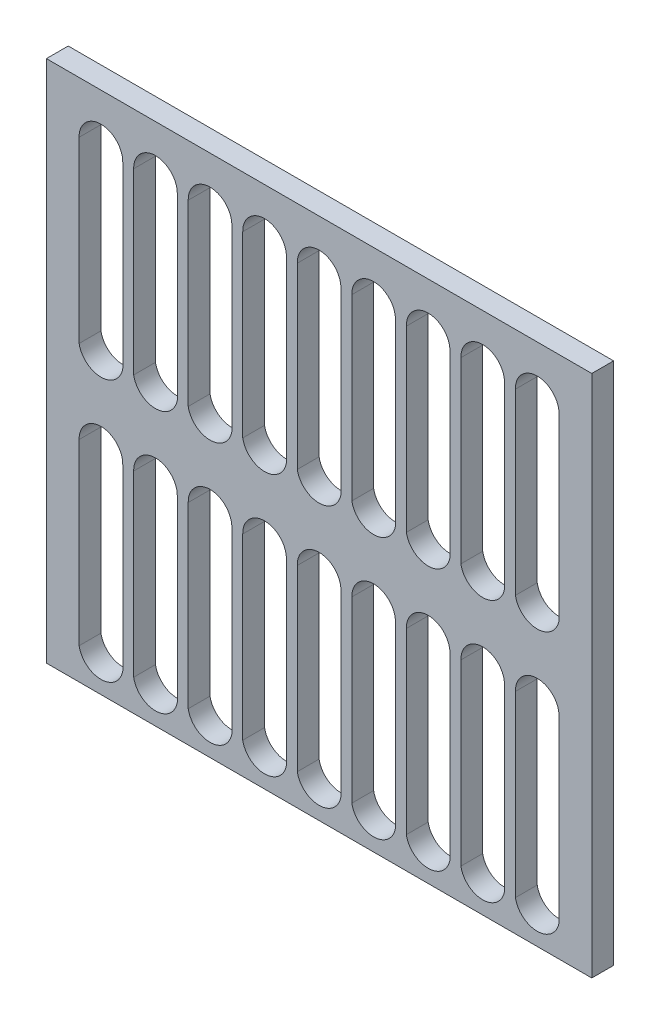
from build123d import *

# Parameters (mm, degrees)
SKETCH1_W           = 250
SKETCH1_H           = 240
BOSS_EXTRUDE2_DEPTH = 10


with BuildPart() as part:
    # Sketch1 → Boss-Extrude2 (new body)
    with BuildSketch(Plane.XY):
        Rectangle(SKETCH1_W, SKETCH1_H)
        with BuildLine():
            Line((-65, -23.72), (-65, -105.6))
            ThreePointArc((-65, -105.6), (-75, -113.956952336), (-85, -105.6))
            Line((-85, -105.6), (-85, -23.72))
            ThreePointArc((-85, -23.72), (-75, -13.517752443), (-65, -23.72))
        make_face(mode=Mode.SUBTRACT)
        with BuildLine():
            Line((-90, -23.72), (-90, -105.6))
            ThreePointArc((-90, -105.6), (-100, -113.956952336), (-110, -105.6))
            Line((-110, -105.6), (-110, -23.72))
            ThreePointArc((-110, -23.72), (-100, -13.517752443), (-90, -23.72))
        make_face(mode=Mode.SUBTRACT)
        with BuildLine():
            Line((-40, -23.72), (-40, -105.6))
            ThreePointArc((-40, -105.6), (-50, -113.956952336), (-60, -105.6))
            Line((-60, -105.6), (-60, -23.72))
            ThreePointArc((-60, -23.72), (-50, -13.517752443), (-40, -23.72))
        make_face(mode=Mode.SUBTRACT)
        with BuildLine():
            Line((-15, -23.72), (-15, -105.6))
            ThreePointArc((-15, -105.6), (-25, -113.956952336), (-35, -105.6))
            Line((-35, -105.6), (-35, -23.72))
            ThreePointArc((-35, -23.72), (-25, -13.517752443), (-15, -23.72))
        make_face(mode=Mode.SUBTRACT)
        with BuildLine():
            Line((10, -23.72), (10, -105.6))
            ThreePointArc((10, -105.6), (0, -113.956952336), (-10, -105.6))
            Line((-10, -105.6), (-10, -23.72))
            ThreePointArc((-10, -23.72), (0, -13.517752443), (10, -23.72))
        make_face(mode=Mode.SUBTRACT)
        with BuildLine():
            Line((35, -23.72), (35, -105.6))
            ThreePointArc((35, -105.6), (25, -113.956952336), (15, -105.6))
            Line((15, -105.6), (15, -23.72))
            ThreePointArc((15, -23.72), (25, -13.517752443), (35, -23.72))
        make_face(mode=Mode.SUBTRACT)
        with BuildLine():
            Line((60, -23.72), (60, -105.6))
            ThreePointArc((60, -105.6), (50, -113.956952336), (40, -105.6))
            Line((40, -105.6), (40, -23.72))
            ThreePointArc((40, -23.72), (50, -13.517752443), (60, -23.72))
        make_face(mode=Mode.SUBTRACT)
        with BuildLine():
            Line((85, -23.72), (85, -105.6))
            ThreePointArc((85, -105.6), (75, -113.956952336), (65, -105.6))
            Line((65, -105.6), (65, -23.72))
            ThreePointArc((65, -23.72), (75, -13.517752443), (85, -23.72))
        make_face(mode=Mode.SUBTRACT)
        with BuildLine():
            Line((110, -23.72), (110, -105.6))
            ThreePointArc((110, -105.6), (100, -113.956952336), (90, -105.6))
            Line((90, -105.6), (90, -23.72))
            ThreePointArc((90, -23.72), (100, -13.517752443), (110, -23.72))
        make_face(mode=Mode.SUBTRACT)
        with BuildLine():
            Line((-65, 96.28), (-65, 14.4))
            ThreePointArc((-65, 14.4), (-75, 6.043047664), (-85, 14.4))
            Line((-85, 14.4), (-85, 96.28))
            ThreePointArc((-85, 96.28), (-75, 106.482247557), (-65, 96.28))
        make_face(mode=Mode.SUBTRACT)
        with BuildLine():
            Line((-40, 96.28), (-40, 14.4))
            ThreePointArc((-40, 14.4), (-50, 6.043047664), (-60, 14.4))
            Line((-60, 14.4), (-60, 96.28))
            ThreePointArc((-60, 96.28), (-50, 106.482247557), (-40, 96.28))
        make_face(mode=Mode.SUBTRACT)
        with BuildLine():
            Line((-15, 96.28), (-15, 14.4))
            ThreePointArc((-15, 14.4), (-25, 6.043047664), (-35, 14.4))
            Line((-35, 14.4), (-35, 96.28))
            ThreePointArc((-35, 96.28), (-25, 106.482247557), (-15, 96.28))
        make_face(mode=Mode.SUBTRACT)
        with BuildLine():
            Line((10, 96.28), (10, 14.4))
            ThreePointArc((10, 14.4), (0, 6.043047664), (-10, 14.4))
            Line((-10, 14.4), (-10, 96.28))
            ThreePointArc((-10, 96.28), (0, 106.482247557), (10, 96.28))
        make_face(mode=Mode.SUBTRACT)
        with BuildLine():
            Line((35, 96.28), (35, 14.4))
            ThreePointArc((35, 14.4), (25, 6.043047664), (15, 14.4))
            Line((15, 14.4), (15, 96.28))
            ThreePointArc((15, 96.28), (25, 106.482247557), (35, 96.28))
        make_face(mode=Mode.SUBTRACT)
        with BuildLine():
            Line((60, 96.28), (60, 14.4))
            ThreePointArc((60, 14.4), (50, 6.043047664), (40, 14.4))
            Line((40, 14.4), (40, 96.28))
            ThreePointArc((40, 96.28), (50, 106.482247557), (60, 96.28))
        make_face(mode=Mode.SUBTRACT)
        with BuildLine():
            Line((85, 96.28), (85, 14.4))
            ThreePointArc((85, 14.4), (75, 6.043047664), (65, 14.4))
            Line((65, 14.4), (65, 96.28))
            ThreePointArc((65, 96.28), (75, 106.482247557), (85, 96.28))
        make_face(mode=Mode.SUBTRACT)
        with BuildLine():
            Line((110, 96.28), (110, 14.4))
            ThreePointArc((110, 14.4), (100, 6.043047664), (90, 14.4))
            Line((90, 14.4), (90, 96.28))
            ThreePointArc((90, 96.28), (100, 106.482247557), (110, 96.28))
        make_face(mode=Mode.SUBTRACT)
        with BuildLine():
            Line((-90, 96.28), (-90, 14.4))
            ThreePointArc((-90, 14.4), (-100, 6.043047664), (-110, 14.4))
            Line((-110, 14.4), (-110, 96.28))
            ThreePointArc((-110, 96.28), (-100, 106.482247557), (-90, 96.28))
        make_face(mode=Mode.SUBTRACT)
    extrude(amount=BOSS_EXTRUDE2_DEPTH)


solid = part.part
